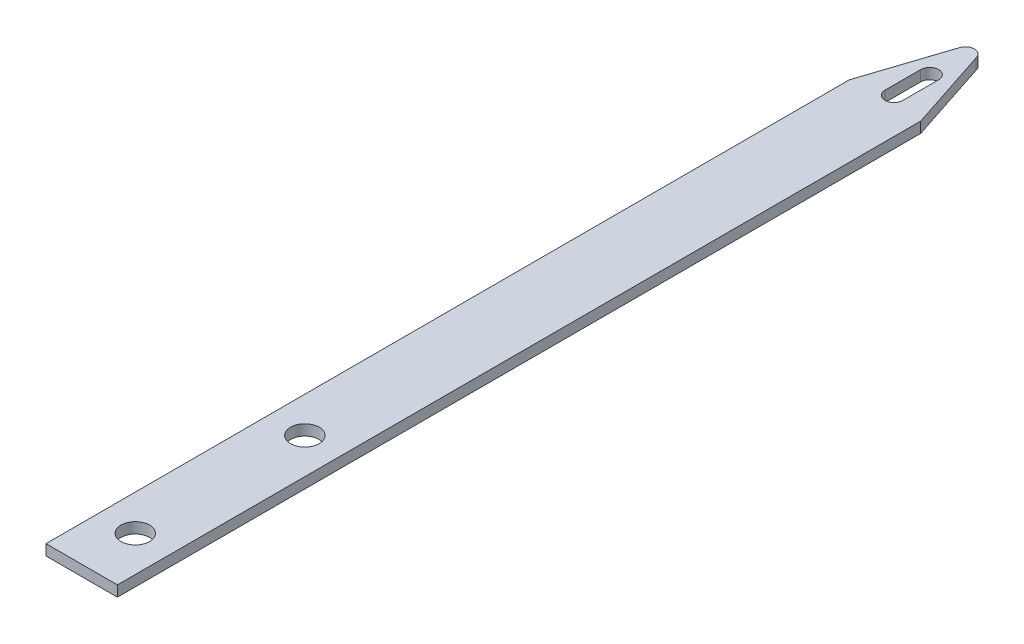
ISO-10303-21;
HEADER;
FILE_DESCRIPTION(('STEP AP214'),'2;1');
FILE_NAME('part.step','',(''),(''),'','','');
FILE_SCHEMA(('AUTOMOTIVE_DESIGN { 1 0 10303 214 1 1 1 1 }'));
ENDSEC;
DATA;
#1=APPLICATION_CONTEXT('core data for automotive mechanical design processes');
#2=APPLICATION_PROTOCOL_DEFINITION('international standard','automotive_design',2000,#1);
#3=PRODUCT_CONTEXT('',#1,'mechanical');
#4=PRODUCT('Part','Part','',(#3));
#5=PRODUCT_RELATED_PRODUCT_CATEGORY('part','',(#4));
#6=PRODUCT_DEFINITION_FORMATION('','',#4);
#7=PRODUCT_DEFINITION_CONTEXT('part definition',#1,'design');
#8=PRODUCT_DEFINITION('design','',#6,#7);
#9=PRODUCT_DEFINITION_SHAPE('','',#8);
#10=(LENGTH_UNIT() NAMED_UNIT(*) SI_UNIT(.MILLI.,.METRE.));
#11=(NAMED_UNIT(*) PLANE_ANGLE_UNIT() SI_UNIT($,.RADIAN.));
#12=(NAMED_UNIT(*) SI_UNIT($,.STERADIAN.) SOLID_ANGLE_UNIT());
#13=UNCERTAINTY_MEASURE_WITH_UNIT(LENGTH_MEASURE(1.E-05),#10,'distance_accuracy_value','');
#14=(GEOMETRIC_REPRESENTATION_CONTEXT(3) GLOBAL_UNCERTAINTY_ASSIGNED_CONTEXT((#13)) GLOBAL_UNIT_ASSIGNED_CONTEXT((#10,
#11,#12)) REPRESENTATION_CONTEXT('',''));
#15=CARTESIAN_POINT('',(0.,0.,0.));
#16=DIRECTION('',(0.,0.,1.));
#17=DIRECTION('',(1.,0.,0.));
#18=AXIS2_PLACEMENT_3D('',#15,#16,#17);
#19=CARTESIAN_POINT('',(0.,0.6,-20.));
#20=DIRECTION('',(0.,1.,0.));
#21=DIRECTION('',(0.,0.,1.));
#22=AXIS2_PLACEMENT_3D('',#19,#20,#21);
#23=PLANE('',#22);
#24=CARTESIAN_POINT('',(2.,0.6,27.));
#25=DIRECTION('',(0.,1.,0.));
#26=DIRECTION('',(0.,0.,1.));
#27=AXIS2_PLACEMENT_3D('',#24,#25,#26);
#28=CIRCLE('',#27,0.8);
#29=CARTESIAN_POINT('',(2.,0.6,27.8));
#30=VERTEX_POINT('',#29);
#31=EDGE_CURVE('E212',#30,#30,#28,.T.);
#32=ORIENTED_EDGE('',*,*,#31,.F.);
#33=EDGE_LOOP('',(#32));
#34=FACE_BOUND('',#33,.T.);
#35=CARTESIAN_POINT('',(2.,0.6,-19.5));
#36=DIRECTION('',(0.,-1.,0.));
#37=DIRECTION('',(0.,0.,-1.));
#38=AXIS2_PLACEMENT_3D('',#35,#36,#37);
#39=CIRCLE('',#38,0.5);
#40=CARTESIAN_POINT('',(1.52483695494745,0.6,-19.6556280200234));
#41=VERTEX_POINT('',#40);
#42=CARTESIAN_POINT('',(2.4903123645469,0.6,-19.5979478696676));
#43=VERTEX_POINT('',#42);
#44=EDGE_CURVE('E253',#41,#43,#39,.T.);
#45=ORIENTED_EDGE('',*,*,#44,.F.);
#46=DIRECTION('',(-0.311256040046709,0.,0.950326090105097));
#47=VECTOR('',#46,1.);
#48=CARTESIAN_POINT('',(5.04754408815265,0.6,-30.4111478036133));
#49=LINE('',#48,#47);
#50=CARTESIAN_POINT('',(0.,0.6,-15.));
#51=VERTEX_POINT('',#50);
#52=EDGE_CURVE('E240',#41,#51,#49,.T.);
#53=ORIENTED_EDGE('',*,*,#52,.T.);
#54=DIRECTION('',(0.,0.,1.));
#55=VECTOR('',#54,1.);
#56=CARTESIAN_POINT('',(0.,0.6,-20.));
#57=LINE('',#56,#55);
#58=CARTESIAN_POINT('',(0.,0.6,30.));
#59=VERTEX_POINT('',#58);
#60=EDGE_CURVE('E12',#51,#59,#57,.T.);
#61=ORIENTED_EDGE('',*,*,#60,.T.);
#62=DIRECTION('',(-1.,0.,0.));
#63=VECTOR('',#62,1.);
#64=CARTESIAN_POINT('',(0.,0.6,30.));
#65=LINE('',#64,#63);
#66=CARTESIAN_POINT('',(4.,0.6,30.));
#67=VERTEX_POINT('',#66);
#68=EDGE_CURVE('E208',#67,#59,#65,.T.);
#69=ORIENTED_EDGE('',*,*,#68,.F.);
#70=DIRECTION('',(0.,0.,1.));
#71=VECTOR('',#70,1.);
#72=CARTESIAN_POINT('',(4.,0.6,-20.));
#73=LINE('',#72,#71);
#74=CARTESIAN_POINT('',(4.,0.6,-15.));
#75=VERTEX_POINT('',#74);
#76=EDGE_CURVE('E114',#75,#67,#73,.T.);
#77=ORIENTED_EDGE('',*,*,#76,.F.);
#78=DIRECTION('',(0.311954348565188,0.,0.95009709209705));
#79=VECTOR('',#78,1.);
#80=CARTESIAN_POINT('',(-1.05813179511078,0.6,-30.405190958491));
#81=LINE('',#80,#79);
#82=EDGE_CURVE('E258',#43,#75,#81,.T.);
#83=ORIENTED_EDGE('',*,*,#82,.F.);
#84=EDGE_LOOP('',(#45,#53,#61,#69,#77,#83));
#85=FACE_BOUND('',#84,.T.);
#86=CARTESIAN_POINT('',(2.,0.6,17.5));
#87=DIRECTION('',(0.,-1.,0.));
#88=DIRECTION('',(0.,0.,-1.));
#89=AXIS2_PLACEMENT_3D('',#86,#87,#88);
#90=CIRCLE('',#89,0.8);
#91=CARTESIAN_POINT('',(2.,0.6,16.7));
#92=VERTEX_POINT('',#91);
#93=EDGE_CURVE('E267',#92,#92,#90,.T.);
#94=ORIENTED_EDGE('',*,*,#93,.T.);
#95=EDGE_LOOP('',(#94));
#96=FACE_BOUND('',#95,.T.);
#97=DIRECTION('',(0.,0.,1.));
#98=VECTOR('',#97,1.);
#99=CARTESIAN_POINT('',(2.5,0.6,-31.4092962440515));
#100=LINE('',#99,#98);
#101=CARTESIAN_POINT('',(2.5,0.6,-17.5));
#102=VERTEX_POINT('',#101);
#103=CARTESIAN_POINT('',(2.5,0.6,-15.5));
#104=VERTEX_POINT('',#103);
#105=EDGE_CURVE('E230',#102,#104,#100,.T.);
#106=ORIENTED_EDGE('',*,*,#105,.T.);
#107=CARTESIAN_POINT('',(2.,0.6,-15.5));
#108=DIRECTION('',(0.,-1.,0.));
#109=DIRECTION('',(0.,0.,-1.));
#110=AXIS2_PLACEMENT_3D('',#107,#108,#109);
#111=CIRCLE('',#110,0.5);
#112=CARTESIAN_POINT('',(1.5,0.6,-15.5));
#113=VERTEX_POINT('',#112);
#114=EDGE_CURVE('E122',#104,#113,#111,.T.);
#115=ORIENTED_EDGE('',*,*,#114,.T.);
#116=DIRECTION('',(0.,0.,1.));
#117=VECTOR('',#116,1.);
#118=CARTESIAN_POINT('',(1.5,0.6,-31.4092962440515));
#119=LINE('',#118,#117);
#120=CARTESIAN_POINT('',(1.5,0.6,-17.5));
#121=VERTEX_POINT('',#120);
#122=EDGE_CURVE('E221',#121,#113,#119,.T.);
#123=ORIENTED_EDGE('',*,*,#122,.F.);
#124=CARTESIAN_POINT('',(2.,0.6,-17.5));
#125=DIRECTION('',(0.,-1.,0.));
#126=DIRECTION('',(0.,0.,-1.));
#127=AXIS2_PLACEMENT_3D('',#124,#125,#126);
#128=CIRCLE('',#127,0.5);
#129=EDGE_CURVE('E233',#121,#102,#128,.T.);
#130=ORIENTED_EDGE('',*,*,#129,.T.);
#131=EDGE_LOOP('',(#106,#115,#123,#130));
#132=FACE_BOUND('',#131,.T.);
#133=ADVANCED_FACE('F105',(#34,#85,#96,#132),#23,.T.);
#134=CARTESIAN_POINT('',(0.,0.,-20.));
#135=DIRECTION('',(0.,-1.,0.));
#136=DIRECTION('',(0.,0.,-1.));
#137=AXIS2_PLACEMENT_3D('',#134,#135,#136);
#138=PLANE('',#137);
#139=CARTESIAN_POINT('',(2.,0.,27.));
#140=DIRECTION('',(0.,1.,0.));
#141=DIRECTION('',(0.,0.,1.));
#142=AXIS2_PLACEMENT_3D('',#139,#140,#141);
#143=CIRCLE('',#142,0.8);
#144=CARTESIAN_POINT('',(2.,0.,27.8));
#145=VERTEX_POINT('',#144);
#146=EDGE_CURVE('E209',#145,#145,#143,.T.);
#147=ORIENTED_EDGE('',*,*,#146,.T.);
#148=EDGE_LOOP('',(#147));
#149=FACE_BOUND('',#148,.T.);
#150=DIRECTION('',(0.,0.,1.));
#151=VECTOR('',#150,1.);
#152=CARTESIAN_POINT('',(0.,0.,-20.));
#153=LINE('',#152,#151);
#154=CARTESIAN_POINT('',(0.,0.,-15.));
#155=VERTEX_POINT('',#154);
#156=CARTESIAN_POINT('',(0.,0.,30.));
#157=VERTEX_POINT('',#156);
#158=EDGE_CURVE('E109',#155,#157,#153,.T.);
#159=ORIENTED_EDGE('',*,*,#158,.F.);
#160=DIRECTION('',(-0.311256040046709,0.,0.950326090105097));
#161=VECTOR('',#160,1.);
#162=CARTESIAN_POINT('',(5.04754408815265,0.,-30.4111478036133));
#163=LINE('',#162,#161);
#164=CARTESIAN_POINT('',(1.52483695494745,0.,-19.6556280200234));
#165=VERTEX_POINT('',#164);
#166=EDGE_CURVE('E249',#165,#155,#163,.T.);
#167=ORIENTED_EDGE('',*,*,#166,.F.);
#168=CARTESIAN_POINT('',(2.,0.,-19.5));
#169=DIRECTION('',(0.,-1.,0.));
#170=DIRECTION('',(0.,0.,-1.));
#171=AXIS2_PLACEMENT_3D('',#168,#169,#170);
#172=CIRCLE('',#171,0.5);
#173=CARTESIAN_POINT('',(2.4903123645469,0.,-19.5979478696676));
#174=VERTEX_POINT('',#173);
#175=EDGE_CURVE('E254',#165,#174,#172,.T.);
#176=ORIENTED_EDGE('',*,*,#175,.T.);
#177=DIRECTION('',(0.311954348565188,0.,0.95009709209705));
#178=VECTOR('',#177,1.);
#179=CARTESIAN_POINT('',(-1.05813179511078,0.,-30.405190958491));
#180=LINE('',#179,#178);
#181=CARTESIAN_POINT('',(4.,0.,-15.));
#182=VERTEX_POINT('',#181);
#183=EDGE_CURVE('E257',#174,#182,#180,.T.);
#184=ORIENTED_EDGE('',*,*,#183,.T.);
#185=DIRECTION('',(0.,0.,1.));
#186=VECTOR('',#185,1.);
#187=CARTESIAN_POINT('',(4.,0.,-20.));
#188=LINE('',#187,#186);
#189=CARTESIAN_POINT('',(4.,0.,30.));
#190=VERTEX_POINT('',#189);
#191=EDGE_CURVE('E192',#182,#190,#188,.T.);
#192=ORIENTED_EDGE('',*,*,#191,.T.);
#193=DIRECTION('',(1.,0.,0.));
#194=VECTOR('',#193,1.);
#195=CARTESIAN_POINT('',(0.,0.,30.));
#196=LINE('',#195,#194);
#197=EDGE_CURVE('E195',#157,#190,#196,.T.);
#198=ORIENTED_EDGE('',*,*,#197,.F.);
#199=EDGE_LOOP('',(#159,#167,#176,#184,#192,#198));
#200=FACE_BOUND('',#199,.T.);
#201=CARTESIAN_POINT('',(2.,0.,17.5));
#202=DIRECTION('',(0.,-1.,0.));
#203=DIRECTION('',(0.,0.,-1.));
#204=AXIS2_PLACEMENT_3D('',#201,#202,#203);
#205=CIRCLE('',#204,0.8);
#206=CARTESIAN_POINT('',(2.,0.,16.7));
#207=VERTEX_POINT('',#206);
#208=EDGE_CURVE('E193',#207,#207,#205,.T.);
#209=ORIENTED_EDGE('',*,*,#208,.F.);
#210=EDGE_LOOP('',(#209));
#211=FACE_BOUND('',#210,.T.);
#212=DIRECTION('',(0.,0.,1.));
#213=VECTOR('',#212,1.);
#214=CARTESIAN_POINT('',(1.5,0.,-31.4092962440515));
#215=LINE('',#214,#213);
#216=CARTESIAN_POINT('',(1.5,0.,-17.5));
#217=VERTEX_POINT('',#216);
#218=CARTESIAN_POINT('',(1.5,0.,-15.5));
#219=VERTEX_POINT('',#218);
#220=EDGE_CURVE('E225',#217,#219,#215,.T.);
#221=ORIENTED_EDGE('',*,*,#220,.T.);
#222=CARTESIAN_POINT('',(2.,0.,-15.5));
#223=DIRECTION('',(0.,-1.,0.));
#224=DIRECTION('',(0.,0.,-1.));
#225=AXIS2_PLACEMENT_3D('',#222,#223,#224);
#226=CIRCLE('',#225,0.5);
#227=CARTESIAN_POINT('',(2.5,0.,-15.5));
#228=VERTEX_POINT('',#227);
#229=EDGE_CURVE('E218',#228,#219,#226,.T.);
#230=ORIENTED_EDGE('',*,*,#229,.F.);
#231=DIRECTION('',(0.,0.,1.));
#232=VECTOR('',#231,1.);
#233=CARTESIAN_POINT('',(2.5,0.,-31.4092962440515));
#234=LINE('',#233,#232);
#235=CARTESIAN_POINT('',(2.5,0.,-17.5));
#236=VERTEX_POINT('',#235);
#237=EDGE_CURVE('E220',#236,#228,#234,.T.);
#238=ORIENTED_EDGE('',*,*,#237,.F.);
#239=CARTESIAN_POINT('',(2.,0.,-17.5));
#240=DIRECTION('',(0.,-1.,0.));
#241=DIRECTION('',(0.,0.,-1.));
#242=AXIS2_PLACEMENT_3D('',#239,#240,#241);
#243=CIRCLE('',#242,0.5);
#244=EDGE_CURVE('E223',#217,#236,#243,.T.);
#245=ORIENTED_EDGE('',*,*,#244,.F.);
#246=EDGE_LOOP('',(#221,#230,#238,#245));
#247=FACE_BOUND('',#246,.T.);
#248=ADVANCED_FACE('F196',(#149,#200,#211,#247),#138,.T.);
#249=CARTESIAN_POINT('',(0.,0.,-20.));
#250=DIRECTION('',(-1.,0.,0.));
#251=DIRECTION('',(0.,0.,1.));
#252=AXIS2_PLACEMENT_3D('',#249,#250,#251);
#253=PLANE('',#252);
#254=ORIENTED_EDGE('',*,*,#60,.F.);
#255=DIRECTION('',(0.,1.,0.));
#256=VECTOR('',#255,1.);
#257=CARTESIAN_POINT('',(0.,0.,-15.));
#258=LINE('',#257,#256);
#259=EDGE_CURVE('E189',#155,#51,#258,.T.);
#260=ORIENTED_EDGE('',*,*,#259,.F.);
#261=ORIENTED_EDGE('',*,*,#158,.T.);
#262=DIRECTION('',(0.,-1.,0.));
#263=VECTOR('',#262,1.);
#264=CARTESIAN_POINT('',(0.,0.6,30.));
#265=LINE('',#264,#263);
#266=EDGE_CURVE('E188',#59,#157,#265,.T.);
#267=ORIENTED_EDGE('',*,*,#266,.F.);
#268=EDGE_LOOP('',(#254,#260,#261,#267));
#269=FACE_BOUND('',#268,.T.);
#270=ADVANCED_FACE('F107',(#269),#253,.T.);
#271=CARTESIAN_POINT('',(4.,0.,-20.));
#272=DIRECTION('',(1.,0.,0.));
#273=DIRECTION('',(0.,0.,-1.));
#274=AXIS2_PLACEMENT_3D('',#271,#272,#273);
#275=PLANE('',#274);
#276=DIRECTION('',(0.,1.,0.));
#277=VECTOR('',#276,1.);
#278=CARTESIAN_POINT('',(4.,0.,-15.));
#279=LINE('',#278,#277);
#280=EDGE_CURVE('E264',#182,#75,#279,.T.);
#281=ORIENTED_EDGE('',*,*,#280,.T.);
#282=ORIENTED_EDGE('',*,*,#76,.T.);
#283=DIRECTION('',(0.,1.,0.));
#284=VECTOR('',#283,1.);
#285=CARTESIAN_POINT('',(4.,0.6,30.));
#286=LINE('',#285,#284);
#287=EDGE_CURVE('E203',#190,#67,#286,.T.);
#288=ORIENTED_EDGE('',*,*,#287,.F.);
#289=ORIENTED_EDGE('',*,*,#191,.F.);
#290=EDGE_LOOP('',(#281,#282,#288,#289));
#291=FACE_BOUND('',#290,.T.);
#292=ADVANCED_FACE('F275',(#291),#275,.T.);
#293=CARTESIAN_POINT('',(2.,0.,17.5));
#294=DIRECTION('',(0.,1.,0.));
#295=DIRECTION('',(0.,0.,1.));
#296=AXIS2_PLACEMENT_3D('',#293,#294,#295);
#297=CYLINDRICAL_SURFACE('',#296,0.8);
#298=ORIENTED_EDGE('',*,*,#208,.T.);
#299=EDGE_LOOP('',(#298));
#300=FACE_BOUND('',#299,.T.);
#301=ORIENTED_EDGE('',*,*,#93,.F.);
#302=EDGE_LOOP('',(#301));
#303=FACE_BOUND('',#302,.T.);
#304=ADVANCED_FACE('F289',(#300,#303),#297,.F.);
#305=CARTESIAN_POINT('',(-1.05813179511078,0.,-30.405190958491));
#306=DIRECTION('',(-0.950097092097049,0.,0.311954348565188));
#307=DIRECTION('',(0.311954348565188,0.,0.95009709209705));
#308=AXIS2_PLACEMENT_3D('',#305,#306,#307);
#309=PLANE('',#308);
#310=ORIENTED_EDGE('',*,*,#82,.T.);
#311=ORIENTED_EDGE('',*,*,#280,.F.);
#312=ORIENTED_EDGE('',*,*,#183,.F.);
#313=DIRECTION('',(0.,1.,0.));
#314=VECTOR('',#313,1.);
#315=CARTESIAN_POINT('',(2.4903123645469,0.,-19.5979478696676));
#316=LINE('',#315,#314);
#317=EDGE_CURVE('E260',#174,#43,#316,.T.);
#318=ORIENTED_EDGE('',*,*,#317,.T.);
#319=EDGE_LOOP('',(#310,#311,#312,#318));
#320=FACE_BOUND('',#319,.T.);
#321=ADVANCED_FACE('F287',(#320),#309,.F.);
#322=CARTESIAN_POINT('',(2.,0.,-19.5));
#323=DIRECTION('',(0.,1.,0.));
#324=DIRECTION('',(0.,0.,1.));
#325=AXIS2_PLACEMENT_3D('',#322,#323,#324);
#326=CYLINDRICAL_SURFACE('',#325,0.5);
#327=ORIENTED_EDGE('',*,*,#44,.T.);
#328=ORIENTED_EDGE('',*,*,#317,.F.);
#329=ORIENTED_EDGE('',*,*,#175,.F.);
#330=DIRECTION('',(0.,1.,0.));
#331=VECTOR('',#330,1.);
#332=CARTESIAN_POINT('',(1.52483695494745,0.,-19.6556280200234));
#333=LINE('',#332,#331);
#334=EDGE_CURVE('E245',#165,#41,#333,.T.);
#335=ORIENTED_EDGE('',*,*,#334,.T.);
#336=EDGE_LOOP('',(#327,#328,#329,#335));
#337=FACE_BOUND('',#336,.T.);
#338=ADVANCED_FACE('F285',(#337),#326,.T.);
#339=CARTESIAN_POINT('',(5.04754408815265,0.,-30.4111478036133));
#340=DIRECTION('',(-0.950326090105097,0.,-0.311256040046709));
#341=DIRECTION('',(-0.311256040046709,0.,0.950326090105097));
#342=AXIS2_PLACEMENT_3D('',#339,#340,#341);
#343=PLANE('',#342);
#344=ORIENTED_EDGE('',*,*,#52,.F.);
#345=ORIENTED_EDGE('',*,*,#334,.F.);
#346=ORIENTED_EDGE('',*,*,#166,.T.);
#347=ORIENTED_EDGE('',*,*,#259,.T.);
#348=EDGE_LOOP('',(#344,#345,#346,#347));
#349=FACE_BOUND('',#348,.T.);
#350=ADVANCED_FACE('F282',(#349),#343,.T.);
#351=CARTESIAN_POINT('',(2.,0.,-15.5));
#352=DIRECTION('',(0.,1.,0.));
#353=DIRECTION('',(0.,0.,1.));
#354=AXIS2_PLACEMENT_3D('',#351,#352,#353);
#355=CYLINDRICAL_SURFACE('',#354,0.5);
#356=ORIENTED_EDGE('',*,*,#114,.F.);
#357=DIRECTION('',(0.,1.,0.));
#358=VECTOR('',#357,1.);
#359=CARTESIAN_POINT('',(2.5,0.,-15.5));
#360=LINE('',#359,#358);
#361=EDGE_CURVE('E228',#228,#104,#360,.T.);
#362=ORIENTED_EDGE('',*,*,#361,.F.);
#363=ORIENTED_EDGE('',*,*,#229,.T.);
#364=DIRECTION('',(0.,1.,0.));
#365=VECTOR('',#364,1.);
#366=CARTESIAN_POINT('',(1.5,0.,-15.5));
#367=LINE('',#366,#365);
#368=EDGE_CURVE('E238',#219,#113,#367,.T.);
#369=ORIENTED_EDGE('',*,*,#368,.T.);
#370=EDGE_LOOP('',(#356,#362,#363,#369));
#371=FACE_BOUND('',#370,.T.);
#372=ADVANCED_FACE('F361',(#371),#355,.F.);
#373=CARTESIAN_POINT('',(1.5,0.,-31.4092962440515));
#374=DIRECTION('',(-1.,0.,0.));
#375=DIRECTION('',(0.,0.,1.));
#376=AXIS2_PLACEMENT_3D('',#373,#374,#375);
#377=PLANE('',#376);
#378=ORIENTED_EDGE('',*,*,#122,.T.);
#379=ORIENTED_EDGE('',*,*,#368,.F.);
#380=ORIENTED_EDGE('',*,*,#220,.F.);
#381=DIRECTION('',(0.,1.,0.));
#382=VECTOR('',#381,1.);
#383=CARTESIAN_POINT('',(1.5,0.,-17.5));
#384=LINE('',#383,#382);
#385=EDGE_CURVE('E241',#217,#121,#384,.T.);
#386=ORIENTED_EDGE('',*,*,#385,.T.);
#387=EDGE_LOOP('',(#378,#379,#380,#386));
#388=FACE_BOUND('',#387,.T.);
#389=ADVANCED_FACE('F353',(#388),#377,.F.);
#390=CARTESIAN_POINT('',(2.,0.,-17.5));
#391=DIRECTION('',(0.,1.,0.));
#392=DIRECTION('',(0.,0.,1.));
#393=AXIS2_PLACEMENT_3D('',#390,#391,#392);
#394=CYLINDRICAL_SURFACE('',#393,0.5);
#395=ORIENTED_EDGE('',*,*,#129,.F.);
#396=ORIENTED_EDGE('',*,*,#385,.F.);
#397=ORIENTED_EDGE('',*,*,#244,.T.);
#398=DIRECTION('',(0.,1.,0.));
#399=VECTOR('',#398,1.);
#400=CARTESIAN_POINT('',(2.5,0.,-17.5));
#401=LINE('',#400,#399);
#402=EDGE_CURVE('E130',#236,#102,#401,.T.);
#403=ORIENTED_EDGE('',*,*,#402,.T.);
#404=EDGE_LOOP('',(#395,#396,#397,#403));
#405=FACE_BOUND('',#404,.T.);
#406=ADVANCED_FACE('F346',(#405),#394,.F.);
#407=CARTESIAN_POINT('',(2.5,0.,-31.4092962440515));
#408=DIRECTION('',(-1.,0.,0.));
#409=DIRECTION('',(0.,0.,1.));
#410=AXIS2_PLACEMENT_3D('',#407,#408,#409);
#411=PLANE('',#410);
#412=ORIENTED_EDGE('',*,*,#105,.F.);
#413=ORIENTED_EDGE('',*,*,#402,.F.);
#414=ORIENTED_EDGE('',*,*,#237,.T.);
#415=ORIENTED_EDGE('',*,*,#361,.T.);
#416=EDGE_LOOP('',(#412,#413,#414,#415));
#417=FACE_BOUND('',#416,.T.);
#418=ADVANCED_FACE('F341',(#417),#411,.T.);
#419=CARTESIAN_POINT('',(0.,0.,30.));
#420=DIRECTION('',(0.,0.,1.));
#421=DIRECTION('',(1.,0.,0.));
#422=AXIS2_PLACEMENT_3D('',#419,#420,#421);
#423=PLANE('',#422);
#424=ORIENTED_EDGE('',*,*,#266,.T.);
#425=ORIENTED_EDGE('',*,*,#197,.T.);
#426=ORIENTED_EDGE('',*,*,#287,.T.);
#427=ORIENTED_EDGE('',*,*,#68,.T.);
#428=EDGE_LOOP('',(#424,#425,#426,#427));
#429=FACE_BOUND('',#428,.T.);
#430=ADVANCED_FACE('F206',(#429),#423,.T.);
#431=CARTESIAN_POINT('',(2.,0.,27.));
#432=DIRECTION('',(0.,1.,0.));
#433=DIRECTION('',(0.,0.,1.));
#434=AXIS2_PLACEMENT_3D('',#431,#432,#433);
#435=CYLINDRICAL_SURFACE('',#434,0.8);
#436=ORIENTED_EDGE('',*,*,#146,.F.);
#437=EDGE_LOOP('',(#436));
#438=FACE_BOUND('',#437,.T.);
#439=ORIENTED_EDGE('',*,*,#31,.T.);
#440=EDGE_LOOP('',(#439));
#441=FACE_BOUND('',#440,.T.);
#442=ADVANCED_FACE('F328',(#438,#441),#435,.F.);
#443=CLOSED_SHELL('',(#133,#248,#270,#292,#304,#321,#338,#350,#372,#389,#406,#418,#430,#442));
#444=MANIFOLD_SOLID_BREP('B2',#443);
#445=ADVANCED_BREP_SHAPE_REPRESENTATION('',(#18,#444),#14);
#446=SHAPE_DEFINITION_REPRESENTATION(#9,#445);
ENDSEC;
END-ISO-10303-21;
